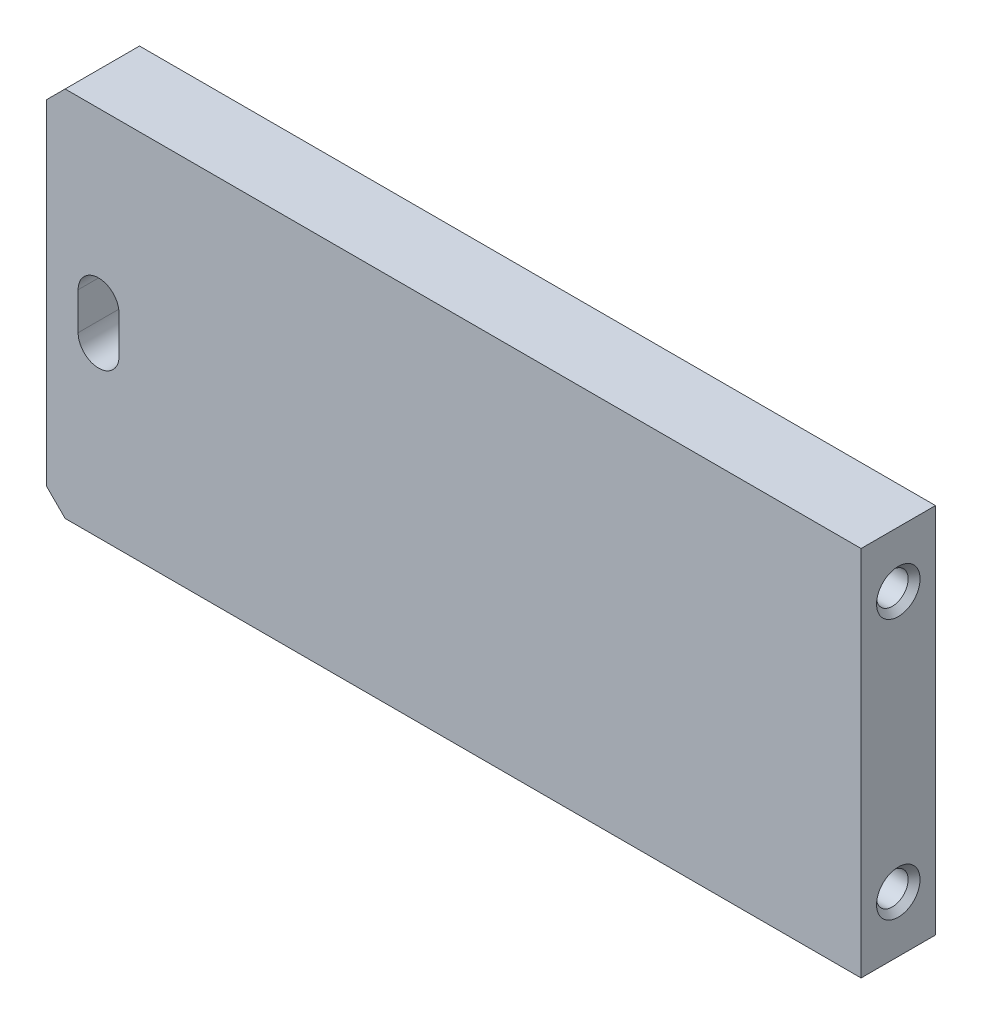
from build123d import *

# Parameters (mm, degrees)
SKETCH_1_W             = 219
SKETCH_1_H             = 100
EXTRUDE_1_DEPTH        = 20
HOLE_WIZARD_M102_D     = 8.5
HOLE_WIZARD_M102_DEPTH = 26
HOLE_WIZARD_M102_TIP   = 2.553657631
CHAMFER_1_SIZE         = 1.6
HOLE_WIZARD_M103_D     = 8.5
HOLE_WIZARD_M103_DEPTH = 26
HOLE_WIZARD_M103_TIP   = 2.553657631
CHAMFER_2_SIZE         = 1.6
CUT_EXTRUDE_1_DEPTH    = 242.580214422
CHAMFER_3_SIZE         = 5


with BuildPart() as part:
    # Sketch 1 → Extrude 1 (new body)
    with BuildSketch(Plane.XY):
        with Locations((109.5, 50)):
            Rectangle(SKETCH_1_W, SKETCH_1_H)
    extrude(amount=EXTRUDE_1_DEPTH)

    # Hole Wizard M102
    with Locations(Plane(origin=(219, 0, 0), x_dir=(0, 0, -1), z_dir=(1, 0, 0))):
        with Locations((-10, 85), (-10, 15)):
            Hole(HOLE_WIZARD_M102_D / 2, depth=HOLE_WIZARD_M102_DEPTH)
            with Locations((0, 0, -(HOLE_WIZARD_M102_DEPTH + HOLE_WIZARD_M102_TIP / 2))):  # 118° drill point
                Cone(0, HOLE_WIZARD_M102_D / 2, HOLE_WIZARD_M102_TIP, mode=Mode.SUBTRACT)

    # Chamfer 1
    chamfer_1_edges = [part.edges().sort_by_distance(p)[0] for p in [
        (219, 15, 5.75),
        (219, 85, 5.75),
    ]]
    chamfer(chamfer_1_edges, length=CHAMFER_1_SIZE)

    # Hole Wizard M103
    with Locations(Plane.ZY):
        with Locations((10, 75), (10, 25)):
            Hole(HOLE_WIZARD_M103_D / 2, depth=HOLE_WIZARD_M103_DEPTH)
            with Locations((0, 0, -(HOLE_WIZARD_M103_DEPTH + HOLE_WIZARD_M103_TIP / 2))):  # 118° drill point
                Cone(0, HOLE_WIZARD_M103_D / 2, HOLE_WIZARD_M103_TIP, mode=Mode.SUBTRACT)

    # Chamfer 2
    chamfer_2_edges = [part.edges().sort_by_distance(p)[0] for p in [
        (0, 25, 14.25),
        (0, 75, 14.25),
    ]]
    chamfer(chamfer_2_edges, length=CHAMFER_2_SIZE)

    # Sketch 8 → Cut-Extrude 1 (cut, through all)
    with BuildSketch(Plane(origin=(0, 0, 0), x_dir=(-1, 0, 0), z_dir=(0, 0, -1))):
        with BuildLine():
            Line((-8.5, 55), (-8.5, 45))
            ThreePointArc((-8.5, 45), (-14, 39.5), (-19.5, 45))
            Line((-19.5, 45), (-19.5, 55))
            ThreePointArc((-19.5, 55), (-14, 60.5), (-8.5, 55))
        make_face()
    extrude(amount=-CUT_EXTRUDE_1_DEPTH, mode=Mode.SUBTRACT)

    # Chamfer 3
    chamfer_3_edges = [part.edges().sort_by_distance(p)[0] for p in [
        (0, 100, 10),
        (0, 0, 10),
    ]]
    chamfer(chamfer_3_edges, length=CHAMFER_3_SIZE)


solid = part.part
